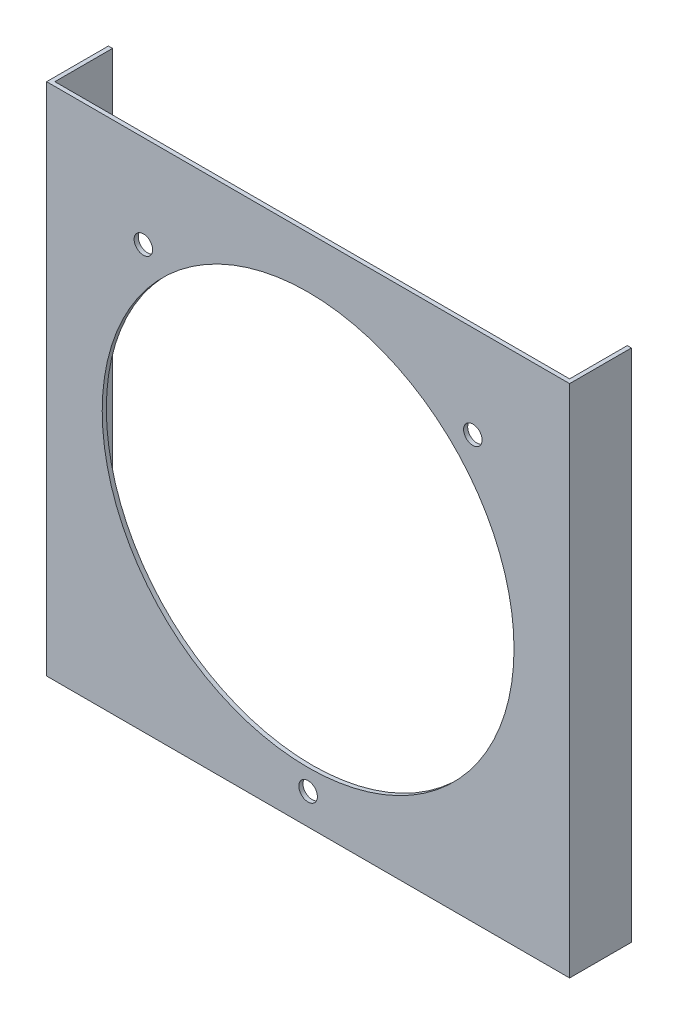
from build123d import *

# Parameters (mm, degrees)
SCHIZZO1_W                   = 250
SCHIZZO1_H                   = 250
SCHIZZO1_R                   = 100
SCHIZZO1_R_2                 = 4.5
ESTRUSIONE_ESTRUSIONE1_DEPTH = 2
SCHIZZO3_W                   = 30
SCHIZZO3_H                   = 250
ESTRUSIONE_ESTRUSIONE2_DEPTH = 2


with BuildPart() as part:
    # Schizzo1 → Estrusione-Estrusione1 (new body)
    with BuildSketch(Plane.XY):
        Rectangle(SCHIZZO1_W, SCHIZZO1_H)
        Circle(SCHIZZO1_R, mode=Mode.SUBTRACT)
        with Locations((-80, 80)):
            Circle(SCHIZZO1_R_2, mode=Mode.SUBTRACT)
        with Locations((80, 80)):
            Circle(SCHIZZO1_R_2, mode=Mode.SUBTRACT)
        with Locations((0, -110)):
            Circle(SCHIZZO1_R_2, mode=Mode.SUBTRACT)
    extrude(amount=ESTRUSIONE_ESTRUSIONE1_DEPTH)

    # Schizzo3 → Estrusione-Estrusione2 (add)
    with BuildSketch(Plane.ZY.offset(125)):
        with Locations((-13, 0)):
            Rectangle(SCHIZZO3_W, SCHIZZO3_H)
    estrusione_estrusione2 = extrude(amount=ESTRUSIONE_ESTRUSIONE2_DEPTH)

    # Specchia1: Estrusione-Estrusione2 across plane
    add(estrusione_estrusione2.mirror(Plane(origin=(0, 0, 0), x_dir=(0, 0, 1), z_dir=(1, 0, 0))))


solid = part.part
